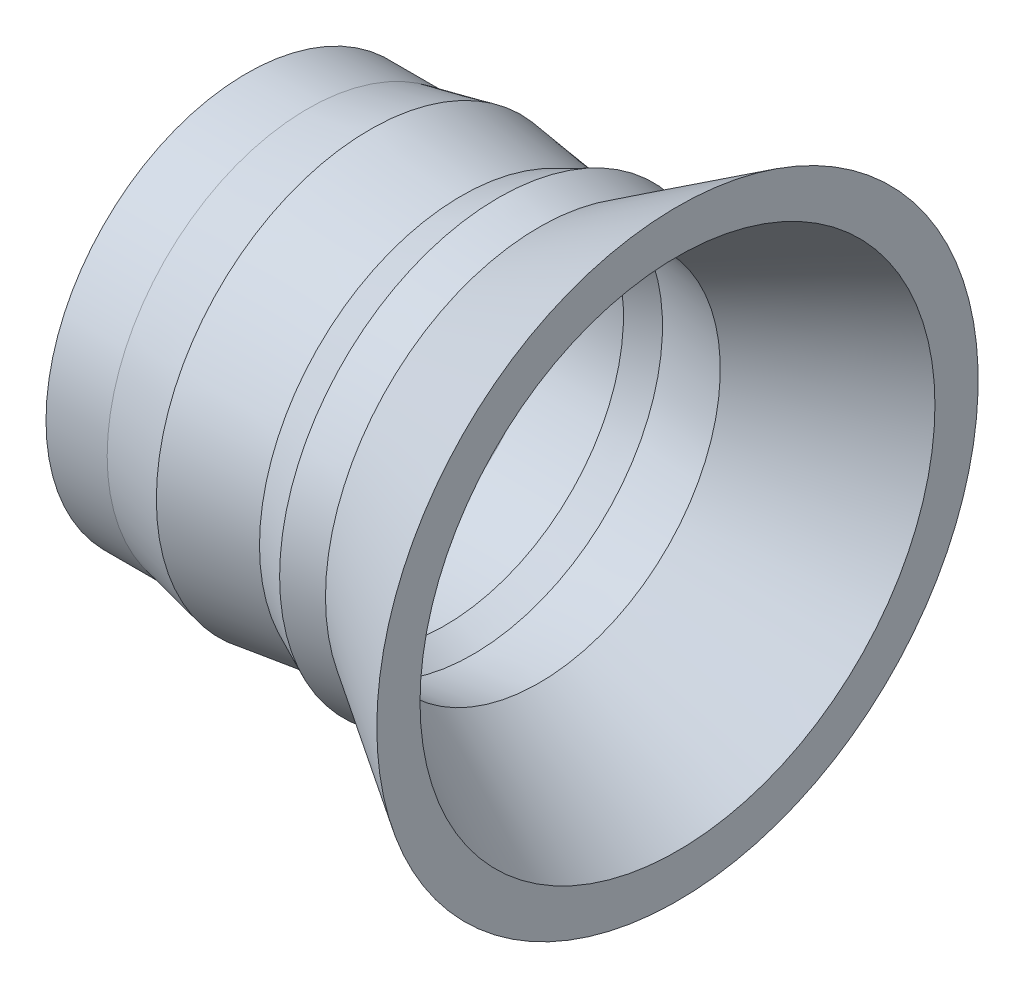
from build123d import *


with BuildPart() as part:
    # Sketch1 → Revolve1 (revolve)
    with BuildSketch(Plane.XY, mode=Mode.PRIVATE) as revolve1_sk:
        Polygon((0, 50.8), (15.502997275, 50.8), (31.282833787, 54.122070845), (54.454502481, 51.155208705), (63.837912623, 55.441457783), (74.142536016, 54.122070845), (109.223637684, 76.2), (109.223637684, 65.245988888), (74.142536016, 45.930920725), (57.342604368, 48.08195619), (50.222222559, 45.31356382), (31.282833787, 45.31356382), (18.10887106, 48.08195619), (0, 48.08195619), align=None)
    revolve(revolve1_sk.sketch.rotate(Axis((0, 0, 0), (1, 0, 0)), 90), axis=Axis((0, 0, 0), (1, 0, 0)))


solid = part.part
